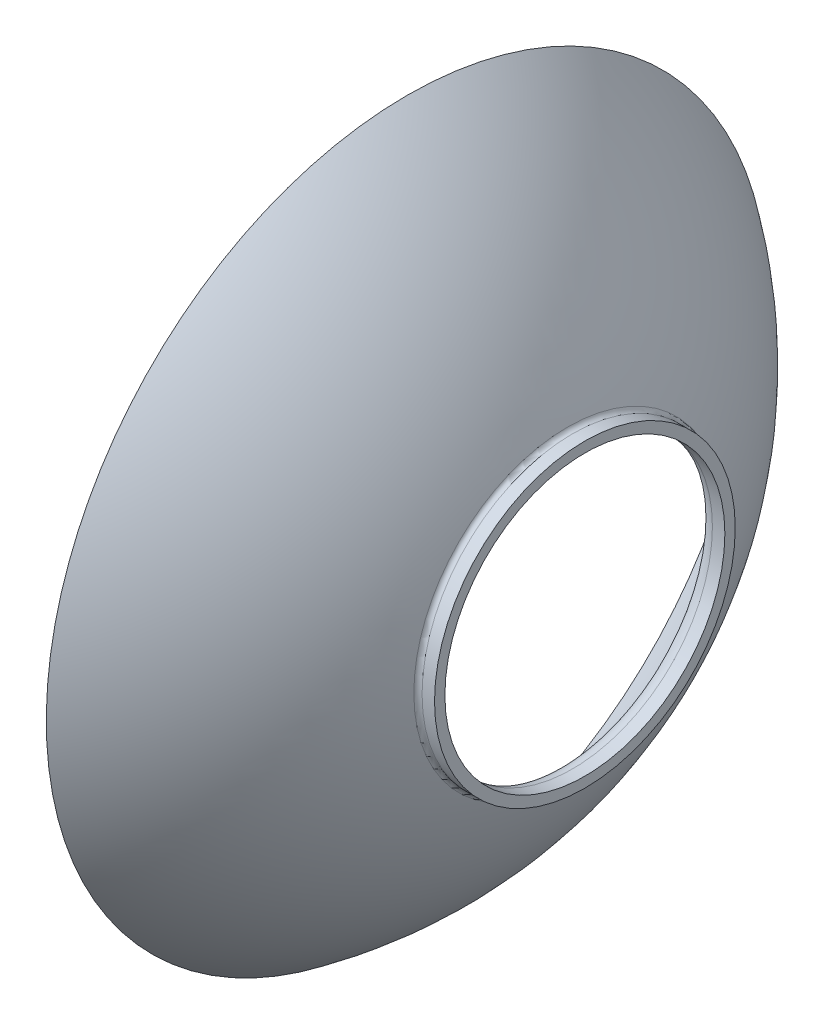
ISO-10303-21;
HEADER;
FILE_DESCRIPTION(('STEP AP214'),'2;1');
FILE_NAME('part.step','',(''),(''),'','','');
FILE_SCHEMA(('AUTOMOTIVE_DESIGN { 1 0 10303 214 1 1 1 1 }'));
ENDSEC;
DATA;
#1=APPLICATION_CONTEXT('core data for automotive mechanical design processes');
#2=APPLICATION_PROTOCOL_DEFINITION('international standard','automotive_design',2000,#1);
#3=PRODUCT_CONTEXT('',#1,'mechanical');
#4=PRODUCT('Part','Part','',(#3));
#5=PRODUCT_RELATED_PRODUCT_CATEGORY('part','',(#4));
#6=PRODUCT_DEFINITION_FORMATION('','',#4);
#7=PRODUCT_DEFINITION_CONTEXT('part definition',#1,'design');
#8=PRODUCT_DEFINITION('design','',#6,#7);
#9=PRODUCT_DEFINITION_SHAPE('','',#8);
#10=(LENGTH_UNIT() NAMED_UNIT(*) SI_UNIT(.MILLI.,.METRE.));
#11=(NAMED_UNIT(*) PLANE_ANGLE_UNIT() SI_UNIT($,.RADIAN.));
#12=(NAMED_UNIT(*) SI_UNIT($,.STERADIAN.) SOLID_ANGLE_UNIT());
#13=UNCERTAINTY_MEASURE_WITH_UNIT(LENGTH_MEASURE(1.E-05),#10,'distance_accuracy_value','');
#14=(GEOMETRIC_REPRESENTATION_CONTEXT(3) GLOBAL_UNCERTAINTY_ASSIGNED_CONTEXT((#13)) GLOBAL_UNIT_ASSIGNED_CONTEXT((#10,
#11,#12)) REPRESENTATION_CONTEXT('',''));
#15=CARTESIAN_POINT('',(0.,0.,0.));
#16=DIRECTION('',(0.,0.,1.));
#17=DIRECTION('',(1.,0.,0.));
#18=AXIS2_PLACEMENT_3D('',#15,#16,#17);
#19=CARTESIAN_POINT('',(0.,0.,0.));
#20=DIRECTION('',(-1.,0.,0.));
#21=DIRECTION('',(0.,0.,1.));
#22=AXIS2_PLACEMENT_3D('',#19,#20,#21);
#23=CYLINDRICAL_SURFACE('',#22,13.5);
#24=CARTESIAN_POINT('',(41.5,0.,0.));
#25=DIRECTION('',(-1.,0.,0.));
#26=DIRECTION('',(0.,0.,1.));
#27=AXIS2_PLACEMENT_3D('',#24,#25,#26);
#28=CIRCLE('',#27,13.5);
#29=CARTESIAN_POINT('',(41.5,0.,13.5));
#30=VERTEX_POINT('',#29);
#31=EDGE_CURVE('E10',#30,#30,#28,.T.);
#32=ORIENTED_EDGE('',*,*,#31,.F.);
#33=EDGE_LOOP('',(#32));
#34=FACE_BOUND('',#33,.T.);
#35=CARTESIAN_POINT('',(40.2988833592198,0.,0.));
#36=DIRECTION('',(-1.,0.,0.));
#37=DIRECTION('',(0.,0.,1.));
#38=AXIS2_PLACEMENT_3D('',#35,#36,#37);
#39=CIRCLE('',#38,13.5);
#40=CARTESIAN_POINT('',(40.2988833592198,0.,13.5));
#41=VERTEX_POINT('',#40);
#42=EDGE_CURVE('E61',#41,#41,#39,.T.);
#43=ORIENTED_EDGE('',*,*,#42,.T.);
#44=EDGE_LOOP('',(#43));
#45=FACE_BOUND('',#44,.T.);
#46=ADVANCED_FACE('F33',(#34,#45),#23,.F.);
#47=CARTESIAN_POINT('',(41.5,14.5,0.));
#48=DIRECTION('',(1.,0.,0.));
#49=DIRECTION('',(0.,0.,-1.));
#50=AXIS2_PLACEMENT_3D('',#47,#48,#49);
#51=PLANE('',#50);
#52=ORIENTED_EDGE('',*,*,#31,.T.);
#53=EDGE_LOOP('',(#52));
#54=FACE_BOUND('',#53,.T.);
#55=CARTESIAN_POINT('',(41.5,0.,0.));
#56=DIRECTION('',(-1.,0.,0.));
#57=DIRECTION('',(0.,0.,1.));
#58=AXIS2_PLACEMENT_3D('',#55,#56,#57);
#59=CIRCLE('',#58,14.5);
#60=CARTESIAN_POINT('',(41.5,0.,14.5));
#61=VERTEX_POINT('',#60);
#62=EDGE_CURVE('E39',#61,#61,#59,.T.);
#63=ORIENTED_EDGE('',*,*,#62,.F.);
#64=EDGE_LOOP('',(#63));
#65=FACE_BOUND('',#64,.T.);
#66=ADVANCED_FACE('F90',(#54,#65),#51,.T.);
#67=CARTESIAN_POINT('',(0.,0.,0.));
#68=DIRECTION('',(-1.,0.,0.));
#69=DIRECTION('',(0.,0.,1.));
#70=AXIS2_PLACEMENT_3D('',#67,#68,#69);
#71=CYLINDRICAL_SURFACE('',#70,14.5);
#72=ORIENTED_EDGE('',*,*,#62,.T.);
#73=EDGE_LOOP('',(#72));
#74=FACE_BOUND('',#73,.T.);
#75=CARTESIAN_POINT('',(40.2988833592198,0.,0.));
#76=DIRECTION('',(-1.,0.,0.));
#77=DIRECTION('',(0.,0.,1.));
#78=AXIS2_PLACEMENT_3D('',#75,#76,#77);
#79=CIRCLE('',#78,14.5);
#80=CARTESIAN_POINT('',(40.2988833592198,0.,14.5));
#81=VERTEX_POINT('',#80);
#82=EDGE_CURVE('E43',#81,#81,#79,.T.);
#83=ORIENTED_EDGE('',*,*,#82,.F.);
#84=EDGE_LOOP('',(#83));
#85=FACE_BOUND('',#84,.T.);
#86=ADVANCED_FACE('F95',(#74,#85),#71,.T.);
#87=CARTESIAN_POINT('',(40.2988833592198,0.,0.));
#88=DIRECTION('',(-1.,0.,0.));
#89=DIRECTION('',(0.,0.,1.));
#90=AXIS2_PLACEMENT_3D('',#87,#88,#89);
#91=TOROIDAL_SURFACE('',#90,15.,0.499999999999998);
#92=ORIENTED_EDGE('',*,*,#82,.T.);
#93=EDGE_LOOP('',(#92));
#94=FACE_BOUND('',#93,.T.);
#95=CARTESIAN_POINT('',(39.8302916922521,0.,0.));
#96=DIRECTION('',(-1.,0.,0.));
#97=DIRECTION('',(0.,0.,1.));
#98=AXIS2_PLACEMENT_3D('',#95,#96,#97);
#99=CIRCLE('',#98,14.8255813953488);
#100=CARTESIAN_POINT('',(39.8302916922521,14.8255813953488,0.));
#101=VERTEX_POINT('',#100);
#102=EDGE_CURVE('E47',#101,#101,#99,.T.);
#103=ORIENTED_EDGE('',*,*,#102,.F.);
#104=EDGE_LOOP('',(#103));
#105=FACE_BOUND('',#104,.T.);
#106=ADVANCED_FACE('F86',(#94,#105),#91,.F.);
#107=CARTESIAN_POINT('',(0.,0.,0.));
#108=DIRECTION('',(-1.,0.,0.));
#109=DIRECTION('',(0.,1.,0.));
#110=AXIS2_PLACEMENT_3D('',#107,#108,#109);
#111=SPHERICAL_SURFACE('',#110,42.5);
#112=CARTESIAN_POINT('',(24.3769985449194,0.,0.));
#113=DIRECTION('',(-1.,0.,0.));
#114=DIRECTION('',(0.,0.,1.));
#115=AXIS2_PLACEMENT_3D('',#112,#113,#114);
#116=CIRCLE('',#115,34.8139618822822);
#117=CARTESIAN_POINT('',(24.3769985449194,34.8139618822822,0.));
#118=VERTEX_POINT('',#117);
#119=EDGE_CURVE('E52',#118,#118,#116,.T.);
#120=CARTESIAN_POINT('',(39.8302916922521,14.8255813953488,0.));
#121=CARTESIAN_POINT('',(39.737075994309,15.076014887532,0.));
#122=CARTESIAN_POINT('',(39.641497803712,15.3255690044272,0.));
#123=CARTESIAN_POINT('',(39.4456517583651,15.8228302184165,0.));
#124=CARTESIAN_POINT('',(39.3453839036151,16.0705373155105,0.));
#125=CARTESIAN_POINT('',(39.1401938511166,16.5640162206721,0.));
#126=CARTESIAN_POINT('',(39.0352716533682,16.8097880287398,0.));
#127=CARTESIAN_POINT('',(38.8208103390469,17.2993089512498,0.));
#128=CARTESIAN_POINT('',(38.7112712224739,17.5430580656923,0.));
#129=CARTESIAN_POINT('',(38.487615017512,18.0284468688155,0.));
#130=CARTESIAN_POINT('',(38.3734979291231,18.2700865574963,0.));
#131=CARTESIAN_POINT('',(38.1407263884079,18.7511705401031,0.));
#132=CARTESIAN_POINT('',(38.0220719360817,18.9906148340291,0.));
#133=CARTESIAN_POINT('',(37.7802678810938,19.467222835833,0.));
#134=CARTESIAN_POINT('',(37.6571182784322,19.7043865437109,0.));
#135=CARTESIAN_POINT('',(37.4063677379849,20.1763489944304,0.));
#136=CARTESIAN_POINT('',(37.2787668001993,20.411147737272,0.));
#137=CARTESIAN_POINT('',(37.0191589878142,20.8782967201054,0.));
#138=CARTESIAN_POINT('',(36.8871521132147,21.1106469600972,0.));
#139=CARTESIAN_POINT('',(36.6187793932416,21.5728162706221,0.));
#140=CARTESIAN_POINT('',(36.482413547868,21.8026353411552,0.));
#141=CARTESIAN_POINT('',(36.2053714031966,22.2596605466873,0.));
#142=CARTESIAN_POINT('',(36.0646951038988,22.4868666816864,0.));
#143=CARTESIAN_POINT('',(35.7790821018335,22.9385851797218,0.));
#144=CARTESIAN_POINT('',(35.634145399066,23.1630975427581,0.));
#145=CARTESIAN_POINT('',(35.3400631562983,23.6093486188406,0.));
#146=CARTESIAN_POINT('',(35.1909176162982,23.8310873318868,0.));
#147=CARTESIAN_POINT('',(34.8884707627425,24.2717122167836,0.));
#148=CARTESIAN_POINT('',(34.7351694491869,24.4905983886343,0.));
#149=CARTESIAN_POINT('',(34.4244655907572,24.9254403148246,0.));
#150=CARTESIAN_POINT('',(34.267063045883,25.1413960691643,0.));
#151=CARTESIAN_POINT('',(33.9482127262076,25.5703003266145,0.));
#152=CARTESIAN_POINT('',(33.7867649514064,25.7832488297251,0.));
#153=CARTESIAN_POINT('',(33.4598816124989,26.2060628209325,0.));
#154=CARTESIAN_POINT('',(33.2944460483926,26.4159283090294,0.));
#155=CARTESIAN_POINT('',(32.9596459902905,26.8325016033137,0.));
#156=CARTESIAN_POINT('',(32.7902814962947,27.0392094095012,0.));
#157=CARTESIAN_POINT('',(32.4476838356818,27.4493937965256,0.));
#158=CARTESIAN_POINT('',(32.2744506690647,27.6528703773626,0.));
#159=CARTESIAN_POINT('',(31.9241772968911,28.0565199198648,0.));
#160=CARTESIAN_POINT('',(31.7471370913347,28.25669288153,0.));
#161=CARTESIAN_POINT('',(31.3893126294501,28.6536639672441,0.));
#162=CARTESIAN_POINT('',(31.2085283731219,28.850462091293,0.));
#163=CARTESIAN_POINT('',(30.8432801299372,29.2406134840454,0.));
#164=CARTESIAN_POINT('',(30.6588161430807,29.4339667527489,0.));
#165=CARTESIAN_POINT('',(30.286274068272,29.8171596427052,0.));
#166=CARTESIAN_POINT('',(30.0981959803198,30.006999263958,0.));
#167=CARTESIAN_POINT('',(29.7184926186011,30.383097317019,0.));
#168=CARTESIAN_POINT('',(29.5268673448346,30.5693557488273,0.));
#169=CARTESIAN_POINT('',(29.1401377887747,30.9382251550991,0.));
#170=CARTESIAN_POINT('',(28.9450335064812,31.1208361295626,0.));
#171=CARTESIAN_POINT('',(28.5514153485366,31.4823456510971,0.));
#172=CARTESIAN_POINT('',(28.3529014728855,31.6612441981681,0.));
#173=CARTESIAN_POINT('',(27.9525347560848,32.0152652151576,0.));
#174=CARTESIAN_POINT('',(27.7506819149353,32.1903876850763,0.));
#175=CARTESIAN_POINT('',(27.3437090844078,32.5367942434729,0.));
#176=CARTESIAN_POINT('',(27.13858909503,32.708078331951,0.));
#177=CARTESIAN_POINT('',(26.725154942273,33.0467471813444,0.));
#178=CARTESIAN_POINT('',(26.5168407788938,33.2141319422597,0.));
#179=CARTESIAN_POINT('',(26.097092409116,33.5449426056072,0.));
#180=CARTESIAN_POINT('',(25.8856582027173,33.7083685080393,0.));
#181=CARTESIAN_POINT('',(25.4597449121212,34.0312032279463,0.));
#182=CARTESIAN_POINT('',(25.2452658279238,34.1906120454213,0.));
#183=CARTESIAN_POINT('',(24.8133393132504,34.5053561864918,0.));
#184=CARTESIAN_POINT('',(24.5958918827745,34.6606915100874,0.));
#185=CARTESIAN_POINT('',(24.3769985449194,34.8139618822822,0.));
#186=B_SPLINE_CURVE_WITH_KNOTS('',3,(#120,#121,#122,#123,#124,#125,#126,#127,#128,#129,#130,
#131,#132,#133,#134,#135,#136,#137,#138,#139,#140,#141,#142,#143,#144,#145,#146,#147,#148,#149,
#150,#151,#152,#153,#154,#155,#156,#157,#158,#159,#160,#161,#162,#163,#164,#165,#166,#167,#168,
#169,#170,#171,#172,#173,#174,#175,#176,#177,#178,#179,#180,#181,#182,#183,#184,#185),
.UNSPECIFIED.,.F.,.F.,(4,2,2,2,2,2,2,2,2,2,2,2,2,2,2,2,2,2,2,2,2,2,2,2,2,2,2,2,2,2,2,2,4),(0.,
0.801645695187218,1.60329139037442,2.40493708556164,3.20658278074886,4.00822847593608,
4.80987417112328,5.6115198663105,6.41316556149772,7.21481125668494,8.01645695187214,
8.81810264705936,9.61974834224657,10.4213940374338,11.223039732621,12.0246854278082,
12.8263311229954,13.6279768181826,14.4296225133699,15.2312682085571,16.0329139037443,
16.8345595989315,17.6362052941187,18.4378509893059,19.2394966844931,20.0411423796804,
20.8427880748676,21.6444337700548,22.446079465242,23.2477251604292,24.0493708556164,
24.8510165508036,25.6526622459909),.UNSPECIFIED.);
#187=EDGE_CURVE('BSEAM80',#101,#118,#186,.T.);
#188=ORIENTED_EDGE('',*,*,#102,.T.);
#189=ORIENTED_EDGE('',*,*,#119,.F.);
#190=ORIENTED_EDGE('',*,*,#187,.T.);
#191=ORIENTED_EDGE('',*,*,#187,.F.);
#192=EDGE_LOOP('',(#188,#190,#189,#191));
#193=FACE_BOUND('',#192,.T.);
#194=ADVANCED_FACE('F80',(#193),#111,.T.);
#195=CARTESIAN_POINT('',(23.8034221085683,0.,0.));
#196=DIRECTION('',(1.,0.,0.));
#197=DIRECTION('',(0.,0.,-1.));
#198=AXIS2_PLACEMENT_3D('',#195,#196,#197);
#199=CONICAL_SURFACE('',#198,33.9948098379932,0.959931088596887);
#200=ORIENTED_EDGE('',*,*,#119,.T.);
#201=EDGE_LOOP('',(#200));
#202=FACE_BOUND('',#201,.T.);
#203=CARTESIAN_POINT('',(23.8034221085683,0.,0.));
#204=DIRECTION('',(-1.,0.,0.));
#205=DIRECTION('',(0.,0.,1.));
#206=AXIS2_PLACEMENT_3D('',#203,#204,#205);
#207=CIRCLE('',#206,33.9948098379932);
#208=CARTESIAN_POINT('',(23.8034221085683,33.9948098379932,0.));
#209=VERTEX_POINT('',#208);
#210=EDGE_CURVE('E55',#209,#209,#207,.T.);
#211=ORIENTED_EDGE('',*,*,#210,.F.);
#212=EDGE_LOOP('',(#211));
#213=FACE_BOUND('',#212,.T.);
#214=ADVANCED_FACE('F75',(#202,#213),#199,.T.);
#215=CARTESIAN_POINT('',(0.,0.,0.));
#216=DIRECTION('',(-1.,0.,0.));
#217=DIRECTION('',(0.,1.,0.));
#218=AXIS2_PLACEMENT_3D('',#215,#216,#217);
#219=SPHERICAL_SURFACE('',#218,41.5);
#220=CARTESIAN_POINT('',(38.8931083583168,0.,0.));
#221=DIRECTION('',(-1.,0.,0.));
#222=DIRECTION('',(0.,0.,1.));
#223=AXIS2_PLACEMENT_3D('',#220,#221,#222);
#224=CIRCLE('',#223,14.4767441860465);
#225=CARTESIAN_POINT('',(38.8931083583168,14.4767441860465,0.));
#226=VERTEX_POINT('',#225);
#227=EDGE_CURVE('E58',#226,#226,#224,.T.);
#228=CARTESIAN_POINT('',(38.8931083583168,14.4767441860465,0.));
#229=CARTESIAN_POINT('',(38.8020859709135,14.7212851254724,0.));
#230=CARTESIAN_POINT('',(38.7087566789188,14.9649673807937,0.));
#231=CARTESIAN_POINT('',(38.5175187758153,15.4505283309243,0.));
#232=CARTESIAN_POINT('',(38.4196101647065,15.6924070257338,0.));
#233=CARTESIAN_POINT('',(38.2192481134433,16.1742746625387,0.));
#234=CARTESIAN_POINT('',(38.116794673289,16.4142636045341,0.));
#235=CARTESIAN_POINT('',(37.9073795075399,16.892266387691,0.));
#236=CARTESIAN_POINT('',(37.8004177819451,17.1302802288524,0.));
#237=CARTESIAN_POINT('',(37.5820240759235,17.604248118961,0.));
#238=CARTESIAN_POINT('',(37.4705920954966,17.8402021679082,0.));
#239=CARTESIAN_POINT('',(37.2432975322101,18.3099665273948,0.));
#240=CARTESIAN_POINT('',(37.1274349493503,18.5437768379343,0.));
#241=CARTESIAN_POINT('',(36.8913204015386,19.0091705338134,0.));
#242=CARTESIAN_POINT('',(36.7710684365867,19.240753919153,0.));
#243=CARTESIAN_POINT('',(36.5262179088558,19.701611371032,0.));
#244=CARTESIAN_POINT('',(36.4016193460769,19.9308854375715,0.));
#245=CARTESIAN_POINT('',(36.1481199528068,20.3870426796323,0.));
#246=CARTESIAN_POINT('',(36.0192191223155,20.6139258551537,0.));
#247=CARTESIAN_POINT('',(35.7571610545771,21.0652205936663,0.));
#248=CARTESIAN_POINT('',(35.62400381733,21.2896321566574,0.));
#249=CARTESIAN_POINT('',(35.3534803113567,21.7359038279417,0.));
#250=CARTESIAN_POINT('',(35.2161140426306,21.9577639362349,0.));
#251=CARTESIAN_POINT('',(34.9372213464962,22.3988537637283,0.));
#252=CARTESIAN_POINT('',(34.7956949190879,22.6180834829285,0.));
#253=CARTESIAN_POINT('',(34.5085322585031,23.0538345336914,0.));
#254=CARTESIAN_POINT('',(34.3628960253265,23.2703558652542,0.));
#255=CARTESIAN_POINT('',(34.0675655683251,23.7006131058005,0.));
#256=CARTESIAN_POINT('',(33.9178713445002,23.914349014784,0.));
#257=CARTESIAN_POINT('',(33.6144781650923,24.3389593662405,0.));
#258=CARTESIAN_POINT('',(33.4607792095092,24.5498338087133,0.));
#259=CARTESIAN_POINT('',(33.1494312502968,24.9686462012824,0.));
#260=CARTESIAN_POINT('',(32.9917822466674,25.1765841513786,0.));
#261=CARTESIAN_POINT('',(32.6725902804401,25.5894495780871,0.));
#262=CARTESIAN_POINT('',(32.5110473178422,25.7943770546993,0.));
#263=CARTESIAN_POINT('',(32.184124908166,26.2011486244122,0.));
#264=CARTESIAN_POINT('',(32.0187454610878,26.4029927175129,0.));
#265=CARTESIAN_POINT('',(31.6842089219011,26.8035257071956,0.));
#266=CARTESIAN_POINT('',(31.5150518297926,27.0022146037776,0.));
#267=CARTESIAN_POINT('',(31.1730201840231,27.3963665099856,0.));
#268=CARTESIAN_POINT('',(31.0001456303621,27.5918295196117,0.));
#269=CARTESIAN_POINT('',(30.6507405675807,27.9794601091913,0.));
#270=CARTESIAN_POINT('',(30.4742100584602,28.1716276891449,0.));
#271=CARTESIAN_POINT('',(30.1175558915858,28.5525990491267,0.));
#272=CARTESIAN_POINT('',(29.9374322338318,28.7414028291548,0.));
#273=CARTESIAN_POINT('',(29.5736558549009,29.115579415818,0.));
#274=CARTESIAN_POINT('',(29.390003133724,29.3009522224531,0.));
#275=CARTESIAN_POINT('',(29.0192339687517,29.6682009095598,0.));
#276=CARTESIAN_POINT('',(28.8321175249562,29.8500767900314,0.));
#277=CARTESIAN_POINT('',(28.4544874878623,30.2102669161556,0.));
#278=CARTESIAN_POINT('',(28.263973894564,30.3885811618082,0.));
#279=CARTESIAN_POINT('',(27.8796173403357,30.7415845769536,0.));
#280=CARTESIAN_POINT('',(27.6857743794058,30.9162737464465,0.));
#281=CARTESIAN_POINT('',(27.2948280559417,31.2619648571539,0.));
#282=CARTESIAN_POINT('',(27.0977246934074,31.4329667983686,0.));
#283=CARTESIAN_POINT('',(26.7003276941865,31.7712226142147,0.));
#284=CARTESIAN_POINT('',(26.5000340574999,31.9384764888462,0.));
#285=CARTESIAN_POINT('',(26.0963277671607,32.2691766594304,0.));
#286=CARTESIAN_POINT('',(25.8929151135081,32.432622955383,0.));
#287=CARTESIAN_POINT('',(25.4830431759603,32.7556498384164,0.));
#288=CARTESIAN_POINT('',(25.2765838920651,32.9152304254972,0.));
#289=CARTESIAN_POINT('',(24.8606920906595,33.2304690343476,0.));
#290=CARTESIAN_POINT('',(24.6512595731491,33.3861270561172,0.));
#291=CARTESIAN_POINT('',(24.2294960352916,33.693465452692,0.));
#292=CARTESIAN_POINT('',(24.0171650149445,33.8451458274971,0.));
#293=CARTESIAN_POINT('',(23.8034221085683,33.9948098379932,0.));
#294=B_SPLINE_CURVE_WITH_KNOTS('',3,(#228,#229,#230,#231,#232,#233,#234,#235,#236,#237,#238,
#239,#240,#241,#242,#243,#244,#245,#246,#247,#248,#249,#250,#251,#252,#253,#254,#255,#256,#257,
#258,#259,#260,#261,#262,#263,#264,#265,#266,#267,#268,#269,#270,#271,#272,#273,#274,#275,#276,
#277,#278,#279,#280,#281,#282,#283,#284,#285,#286,#287,#288,#289,#290,#291,#292,#293),
.UNSPECIFIED.,.F.,.F.,(4,2,2,2,2,2,2,2,2,2,2,2,2,2,2,2,2,2,2,2,2,2,2,2,2,2,2,2,2,2,2,2,4),(0.,
0.782783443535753,1.5655668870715,2.34835033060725,3.131133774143,3.91391721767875,
4.6967006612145,5.47948410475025,6.262267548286,7.04505099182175,7.82783443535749,
8.61061787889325,9.393401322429,10.1761847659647,10.9589682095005,11.7417516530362,
12.524535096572,13.3073185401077,14.0901019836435,14.8728854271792,15.655668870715,
16.4384523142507,17.2212357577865,18.0040192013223,18.786802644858,19.5695860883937,
20.3523695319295,21.1351529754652,21.917936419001,22.7007198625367,23.4835033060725,
24.2662867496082,25.049070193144),.UNSPECIFIED.);
#295=EDGE_CURVE('BSEAM69',#226,#209,#294,.T.);
#296=ORIENTED_EDGE('',*,*,#227,.F.);
#297=ORIENTED_EDGE('',*,*,#210,.T.);
#298=ORIENTED_EDGE('',*,*,#295,.T.);
#299=ORIENTED_EDGE('',*,*,#295,.F.);
#300=EDGE_LOOP('',(#296,#298,#297,#299));
#301=FACE_BOUND('',#300,.T.);
#302=ADVANCED_FACE('F69',(#301),#219,.F.);
#303=CARTESIAN_POINT('',(40.2988833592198,0.,0.));
#304=DIRECTION('',(-1.,0.,0.));
#305=DIRECTION('',(0.,0.,1.));
#306=AXIS2_PLACEMENT_3D('',#303,#304,#305);
#307=TOROIDAL_SURFACE('',#306,15.,1.5);
#308=ORIENTED_EDGE('',*,*,#42,.F.);
#309=EDGE_LOOP('',(#308));
#310=FACE_BOUND('',#309,.T.);
#311=ORIENTED_EDGE('',*,*,#227,.T.);
#312=EDGE_LOOP('',(#311));
#313=FACE_BOUND('',#312,.T.);
#314=ADVANCED_FACE('F66',(#310,#313),#307,.T.);
#315=CLOSED_SHELL('',(#46,#66,#86,#106,#194,#214,#302,#314));
#316=MANIFOLD_SOLID_BREP('B2',#315);
#317=ADVANCED_BREP_SHAPE_REPRESENTATION('',(#18,#316),#14);
#318=SHAPE_DEFINITION_REPRESENTATION(#9,#317);
ENDSEC;
END-ISO-10303-21;
